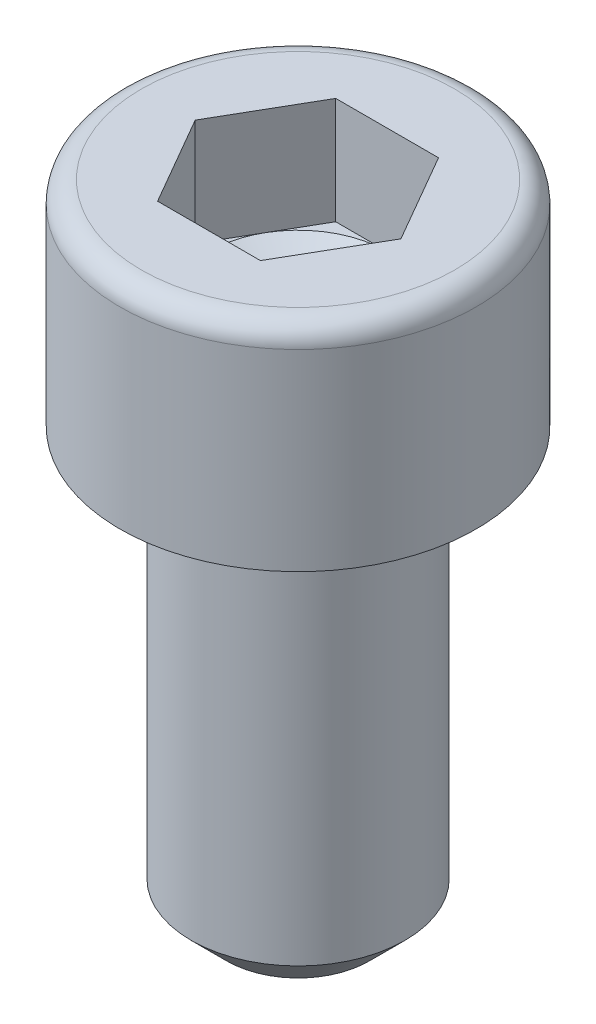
ISO-10303-21;
HEADER;
FILE_DESCRIPTION(('STEP AP214'),'2;1');
FILE_NAME('part.step','',(''),(''),'','','');
FILE_SCHEMA(('AUTOMOTIVE_DESIGN { 1 0 10303 214 1 1 1 1 }'));
ENDSEC;
DATA;
#1=APPLICATION_CONTEXT('core data for automotive mechanical design processes');
#2=APPLICATION_PROTOCOL_DEFINITION('international standard','automotive_design',2000,#1);
#3=PRODUCT_CONTEXT('',#1,'mechanical');
#4=PRODUCT('Part','Part','',(#3));
#5=PRODUCT_RELATED_PRODUCT_CATEGORY('part','',(#4));
#6=PRODUCT_DEFINITION_FORMATION('','',#4);
#7=PRODUCT_DEFINITION_CONTEXT('part definition',#1,'design');
#8=PRODUCT_DEFINITION('design','',#6,#7);
#9=PRODUCT_DEFINITION_SHAPE('','',#8);
#10=(LENGTH_UNIT() NAMED_UNIT(*) SI_UNIT(.MILLI.,.METRE.));
#11=(NAMED_UNIT(*) PLANE_ANGLE_UNIT() SI_UNIT($,.RADIAN.));
#12=(NAMED_UNIT(*) SI_UNIT($,.STERADIAN.) SOLID_ANGLE_UNIT());
#13=UNCERTAINTY_MEASURE_WITH_UNIT(LENGTH_MEASURE(1.E-05),#10,'distance_accuracy_value','');
#14=(GEOMETRIC_REPRESENTATION_CONTEXT(3) GLOBAL_UNCERTAINTY_ASSIGNED_CONTEXT((#13)) GLOBAL_UNIT_ASSIGNED_CONTEXT((#10,
#11,#12)) REPRESENTATION_CONTEXT('',''));
#15=CARTESIAN_POINT('',(0.,0.,0.));
#16=DIRECTION('',(0.,0.,1.));
#17=DIRECTION('',(1.,0.,0.));
#18=AXIS2_PLACEMENT_3D('',#15,#16,#17);
#19=CARTESIAN_POINT('',(2.5,6.,0.));
#20=DIRECTION('',(0.,-1.,0.));
#21=DIRECTION('',(1.,0.,0.));
#22=AXIS2_PLACEMENT_3D('',#19,#20,#21);
#23=PLANE('',#22);
#24=CARTESIAN_POINT('',(0.,6.,0.));
#25=DIRECTION('',(0.,1.,0.));
#26=DIRECTION('',(-1.,0.,0.));
#27=AXIS2_PLACEMENT_3D('',#24,#25,#26);
#28=CIRCLE('',#27,4.4);
#29=CARTESIAN_POINT('',(-4.4,6.,0.));
#30=VERTEX_POINT('',#29);
#31=EDGE_CURVE('E140',#30,#30,#28,.T.);
#32=ORIENTED_EDGE('',*,*,#31,.T.);
#33=EDGE_LOOP('',(#32));
#34=FACE_BOUND('',#33,.T.);
#35=DIRECTION('',(0.499999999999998,0.,0.86602540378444));
#36=VECTOR('',#35,1.);
#37=CARTESIAN_POINT('',(1.44337567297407,6.,-2.5));
#38=LINE('',#37,#36);
#39=CARTESIAN_POINT('',(1.44337567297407,6.,-2.5));
#40=VERTEX_POINT('',#39);
#41=CARTESIAN_POINT('',(2.88675134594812,6.,0.));
#42=VERTEX_POINT('',#41);
#43=EDGE_CURVE('E372',#40,#42,#38,.T.);
#44=ORIENTED_EDGE('',*,*,#43,.T.);
#45=DIRECTION('',(-0.499999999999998,0.,0.86602540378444));
#46=VECTOR('',#45,1.);
#47=CARTESIAN_POINT('',(1.44337567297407,6.,2.5));
#48=LINE('',#47,#46);
#49=CARTESIAN_POINT('',(1.44337567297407,6.,2.5));
#50=VERTEX_POINT('',#49);
#51=EDGE_CURVE('E375',#42,#50,#48,.T.);
#52=ORIENTED_EDGE('',*,*,#51,.T.);
#53=DIRECTION('',(-1.,0.,0.));
#54=VECTOR('',#53,1.);
#55=CARTESIAN_POINT('',(1.44337567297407,6.,2.5));
#56=LINE('',#55,#54);
#57=CARTESIAN_POINT('',(-1.44337567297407,6.,2.5));
#58=VERTEX_POINT('',#57);
#59=EDGE_CURVE('E378',#50,#58,#56,.T.);
#60=ORIENTED_EDGE('',*,*,#59,.T.);
#61=DIRECTION('',(-0.499999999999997,0.,-0.86602540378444));
#62=VECTOR('',#61,1.);
#63=CARTESIAN_POINT('',(-1.44337567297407,6.,2.5));
#64=LINE('',#63,#62);
#65=CARTESIAN_POINT('',(-2.88675134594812,6.,0.));
#66=VERTEX_POINT('',#65);
#67=EDGE_CURVE('E117',#58,#66,#64,.T.);
#68=ORIENTED_EDGE('',*,*,#67,.T.);
#69=DIRECTION('',(0.499999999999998,0.,-0.86602540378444));
#70=VECTOR('',#69,1.);
#71=CARTESIAN_POINT('',(-1.44337567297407,6.,-2.5));
#72=LINE('',#71,#70);
#73=CARTESIAN_POINT('',(-1.44337567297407,6.,-2.5));
#74=VERTEX_POINT('',#73);
#75=EDGE_CURVE('E369',#66,#74,#72,.T.);
#76=ORIENTED_EDGE('',*,*,#75,.T.);
#77=DIRECTION('',(1.,0.,0.));
#78=VECTOR('',#77,1.);
#79=CARTESIAN_POINT('',(1.44337567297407,6.,-2.5));
#80=LINE('',#79,#78);
#81=EDGE_CURVE('E128',#74,#40,#80,.T.);
#82=ORIENTED_EDGE('',*,*,#81,.T.);
#83=EDGE_LOOP('',(#44,#52,#60,#68,#76,#82));
#84=FACE_BOUND('',#83,.T.);
#85=ADVANCED_FACE('F34',(#34,#84),#23,.F.);
#86=CARTESIAN_POINT('',(0.,-12.,0.));
#87=DIRECTION('',(0.,1.,0.));
#88=DIRECTION('',(0.,0.,1.));
#89=AXIS2_PLACEMENT_3D('',#86,#87,#88);
#90=CYLINDRICAL_SURFACE('',#89,3.);
#91=CARTESIAN_POINT('',(0.,-11.,0.));
#92=DIRECTION('',(0.,1.,0.));
#93=DIRECTION('',(0.,0.,1.));
#94=AXIS2_PLACEMENT_3D('',#91,#92,#93);
#95=CIRCLE('',#94,3.);
#96=CARTESIAN_POINT('',(0.,-11.,3.));
#97=VERTEX_POINT('',#96);
#98=EDGE_CURVE('E42',#97,#97,#95,.T.);
#99=ORIENTED_EDGE('',*,*,#98,.T.);
#100=EDGE_LOOP('',(#99));
#101=FACE_BOUND('',#100,.T.);
#102=CARTESIAN_POINT('',(0.,0.,0.));
#103=DIRECTION('',(0.,1.,0.));
#104=DIRECTION('',(0.,0.,1.));
#105=AXIS2_PLACEMENT_3D('',#102,#103,#104);
#106=CIRCLE('',#105,3.);
#107=CARTESIAN_POINT('',(0.,0.,3.));
#108=VERTEX_POINT('',#107);
#109=EDGE_CURVE('E150',#108,#108,#106,.T.);
#110=ORIENTED_EDGE('',*,*,#109,.F.);
#111=EDGE_LOOP('',(#110));
#112=FACE_BOUND('',#111,.T.);
#113=ADVANCED_FACE('F155',(#101,#112),#90,.T.);
#114=CARTESIAN_POINT('',(0.,-12.,0.));
#115=DIRECTION('',(0.,1.,0.));
#116=DIRECTION('',(0.,0.,1.));
#117=AXIS2_PLACEMENT_3D('',#114,#115,#116);
#118=PLANE('',#117);
#119=CARTESIAN_POINT('',(0.,-12.,0.));
#120=DIRECTION('',(0.,1.,0.));
#121=DIRECTION('',(0.,0.,1.));
#122=AXIS2_PLACEMENT_3D('',#119,#120,#121);
#123=CIRCLE('',#122,2.);
#124=CARTESIAN_POINT('',(0.,-12.,2.));
#125=VERTEX_POINT('',#124);
#126=EDGE_CURVE('E11',#125,#125,#123,.F.);
#127=ORIENTED_EDGE('',*,*,#126,.T.);
#128=EDGE_LOOP('',(#127));
#129=FACE_BOUND('',#128,.T.);
#130=ADVANCED_FACE('F160',(#129),#118,.F.);
#131=CARTESIAN_POINT('',(0.,-11.,0.));
#132=DIRECTION('',(0.,1.,0.));
#133=DIRECTION('',(0.,0.,1.));
#134=AXIS2_PLACEMENT_3D('',#131,#132,#133);
#135=CONICAL_SURFACE('',#134,3.,0.78539816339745);
#136=ORIENTED_EDGE('',*,*,#126,.F.);
#137=EDGE_LOOP('',(#136));
#138=FACE_BOUND('',#137,.T.);
#139=ORIENTED_EDGE('',*,*,#98,.F.);
#140=EDGE_LOOP('',(#139));
#141=FACE_BOUND('',#140,.T.);
#142=ADVANCED_FACE('F36',(#138,#141),#135,.T.);
#143=CARTESIAN_POINT('',(0.,0.,0.));
#144=DIRECTION('',(0.,1.,0.));
#145=DIRECTION('',(-1.,0.,0.));
#146=AXIS2_PLACEMENT_3D('',#143,#144,#145);
#147=PLANE('',#146);
#148=ORIENTED_EDGE('',*,*,#109,.T.);
#149=EDGE_LOOP('',(#148));
#150=FACE_BOUND('',#149,.T.);
#151=CARTESIAN_POINT('',(0.,0.,0.));
#152=DIRECTION('',(0.,1.,0.));
#153=DIRECTION('',(-1.,0.,0.));
#154=AXIS2_PLACEMENT_3D('',#151,#152,#153);
#155=CIRCLE('',#154,5.);
#156=CARTESIAN_POINT('',(-5.,0.,0.));
#157=VERTEX_POINT('',#156);
#158=EDGE_CURVE('E147',#157,#157,#155,.T.);
#159=ORIENTED_EDGE('',*,*,#158,.F.);
#160=EDGE_LOOP('',(#159));
#161=FACE_BOUND('',#160,.T.);
#162=ADVANCED_FACE('F159',(#150,#161),#147,.F.);
#163=CARTESIAN_POINT('',(0.,6.,0.));
#164=DIRECTION('',(0.,1.,0.));
#165=DIRECTION('',(-1.,0.,0.));
#166=AXIS2_PLACEMENT_3D('',#163,#164,#165);
#167=CYLINDRICAL_SURFACE('',#166,5.);
#168=CARTESIAN_POINT('',(0.,5.4,0.));
#169=DIRECTION('',(0.,1.,0.));
#170=DIRECTION('',(-1.,0.,0.));
#171=AXIS2_PLACEMENT_3D('',#168,#169,#170);
#172=CIRCLE('',#171,5.);
#173=CARTESIAN_POINT('',(-5.,5.4,0.));
#174=VERTEX_POINT('',#173);
#175=EDGE_CURVE('E144',#174,#174,#172,.T.);
#176=ORIENTED_EDGE('',*,*,#175,.F.);
#177=EDGE_LOOP('',(#176));
#178=FACE_BOUND('',#177,.T.);
#179=ORIENTED_EDGE('',*,*,#158,.T.);
#180=EDGE_LOOP('',(#179));
#181=FACE_BOUND('',#180,.T.);
#182=ADVANCED_FACE('F166',(#178,#181),#167,.T.);
#183=CARTESIAN_POINT('',(0.,5.4,0.));
#184=DIRECTION('',(0.,1.,0.));
#185=DIRECTION('',(-1.,0.,0.));
#186=AXIS2_PLACEMENT_3D('',#183,#184,#185);
#187=TOROIDAL_SURFACE('',#186,4.4,0.6);
#188=ORIENTED_EDGE('',*,*,#31,.F.);
#189=EDGE_LOOP('',(#188));
#190=FACE_BOUND('',#189,.T.);
#191=ORIENTED_EDGE('',*,*,#175,.T.);
#192=EDGE_LOOP('',(#191));
#193=FACE_BOUND('',#192,.T.);
#194=ADVANCED_FACE('F183',(#190,#193),#187,.T.);
#195=CARTESIAN_POINT('',(-1.44337567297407,3.,-2.5));
#196=DIRECTION('',(0.86602540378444,0.,0.499999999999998));
#197=DIRECTION('',(0.499999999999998,0.,-0.86602540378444));
#198=AXIS2_PLACEMENT_3D('',#195,#196,#197);
#199=PLANE('',#198);
#200=ORIENTED_EDGE('',*,*,#75,.F.);
#201=DIRECTION('',(0.,1.,0.));
#202=VECTOR('',#201,1.);
#203=CARTESIAN_POINT('',(-2.88675134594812,3.,0.));
#204=LINE('',#203,#202);
#205=CARTESIAN_POINT('',(-2.88675134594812,3.,0.));
#206=VERTEX_POINT('',#205);
#207=EDGE_CURVE('E364',#206,#66,#204,.T.);
#208=ORIENTED_EDGE('',*,*,#207,.F.);
#209=DIRECTION('',(0.499999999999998,0.,-0.86602540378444));
#210=VECTOR('',#209,1.);
#211=CARTESIAN_POINT('',(-1.44337567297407,3.,-2.5));
#212=LINE('',#211,#210);
#213=CARTESIAN_POINT('',(-2.1650635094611,3.,-1.24999999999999));
#214=VERTEX_POINT('',#213);
#215=EDGE_CURVE('E113',#206,#214,#212,.T.);
#216=ORIENTED_EDGE('',*,*,#215,.T.);
#217=CARTESIAN_POINT('',(-1.44337567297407,3.,-2.5));
#218=VERTEX_POINT('',#217);
#219=EDGE_CURVE('E107',#214,#218,#212,.T.);
#220=ORIENTED_EDGE('',*,*,#219,.T.);
#221=DIRECTION('',(0.,1.,0.));
#222=VECTOR('',#221,1.);
#223=CARTESIAN_POINT('',(-1.44337567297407,3.,-2.5));
#224=LINE('',#223,#222);
#225=EDGE_CURVE('E109',#218,#74,#224,.T.);
#226=ORIENTED_EDGE('',*,*,#225,.T.);
#227=EDGE_LOOP('',(#200,#208,#216,#220,#226));
#228=FACE_BOUND('',#227,.T.);
#229=ADVANCED_FACE('F108',(#228),#199,.T.);
#230=CARTESIAN_POINT('',(1.44337567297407,3.,-2.5));
#231=DIRECTION('',(0.,0.,1.));
#232=DIRECTION('',(1.,0.,0.));
#233=AXIS2_PLACEMENT_3D('',#230,#231,#232);
#234=PLANE('',#233);
#235=ORIENTED_EDGE('',*,*,#81,.F.);
#236=ORIENTED_EDGE('',*,*,#225,.F.);
#237=DIRECTION('',(1.,0.,0.));
#238=VECTOR('',#237,1.);
#239=CARTESIAN_POINT('',(1.44337567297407,3.,-2.5));
#240=LINE('',#239,#238);
#241=CARTESIAN_POINT('',(0.,3.,-2.5));
#242=VERTEX_POINT('',#241);
#243=EDGE_CURVE('E49',#218,#242,#240,.T.);
#244=ORIENTED_EDGE('',*,*,#243,.T.);
#245=CARTESIAN_POINT('',(1.44337567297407,3.,-2.5));
#246=VERTEX_POINT('',#245);
#247=EDGE_CURVE('E123',#242,#246,#240,.T.);
#248=ORIENTED_EDGE('',*,*,#247,.T.);
#249=DIRECTION('',(0.,1.,0.));
#250=VECTOR('',#249,1.);
#251=CARTESIAN_POINT('',(1.44337567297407,3.,-2.5));
#252=LINE('',#251,#250);
#253=EDGE_CURVE('E130',#246,#40,#252,.T.);
#254=ORIENTED_EDGE('',*,*,#253,.T.);
#255=EDGE_LOOP('',(#235,#236,#244,#248,#254));
#256=FACE_BOUND('',#255,.T.);
#257=ADVANCED_FACE('F125',(#256),#234,.T.);
#258=CARTESIAN_POINT('',(1.44337567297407,3.,-2.5));
#259=DIRECTION('',(-0.86602540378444,0.,0.499999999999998));
#260=DIRECTION('',(0.499999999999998,0.,0.86602540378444));
#261=AXIS2_PLACEMENT_3D('',#258,#259,#260);
#262=PLANE('',#261);
#263=ORIENTED_EDGE('',*,*,#43,.F.);
#264=ORIENTED_EDGE('',*,*,#253,.F.);
#265=DIRECTION('',(0.499999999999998,0.,0.86602540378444));
#266=VECTOR('',#265,1.);
#267=CARTESIAN_POINT('',(1.44337567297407,3.,-2.5));
#268=LINE('',#267,#266);
#269=CARTESIAN_POINT('',(2.1650635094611,3.,-1.24999999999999));
#270=VERTEX_POINT('',#269);
#271=EDGE_CURVE('E397',#246,#270,#268,.T.);
#272=ORIENTED_EDGE('',*,*,#271,.T.);
#273=CARTESIAN_POINT('',(2.88675134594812,3.,0.));
#274=VERTEX_POINT('',#273);
#275=EDGE_CURVE('E122',#270,#274,#268,.T.);
#276=ORIENTED_EDGE('',*,*,#275,.T.);
#277=DIRECTION('',(0.,1.,0.));
#278=VECTOR('',#277,1.);
#279=CARTESIAN_POINT('',(2.88675134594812,3.,0.));
#280=LINE('',#279,#278);
#281=EDGE_CURVE('E135',#274,#42,#280,.T.);
#282=ORIENTED_EDGE('',*,*,#281,.T.);
#283=EDGE_LOOP('',(#263,#264,#272,#276,#282));
#284=FACE_BOUND('',#283,.T.);
#285=ADVANCED_FACE('F213',(#284),#262,.T.);
#286=CARTESIAN_POINT('',(1.44337567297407,3.,2.5));
#287=DIRECTION('',(-0.86602540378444,0.,-0.499999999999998));
#288=DIRECTION('',(-0.499999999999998,0.,0.86602540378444));
#289=AXIS2_PLACEMENT_3D('',#286,#287,#288);
#290=PLANE('',#289);
#291=ORIENTED_EDGE('',*,*,#51,.F.);
#292=ORIENTED_EDGE('',*,*,#281,.F.);
#293=DIRECTION('',(-0.499999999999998,0.,0.86602540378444));
#294=VECTOR('',#293,1.);
#295=CARTESIAN_POINT('',(1.44337567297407,3.,2.5));
#296=LINE('',#295,#294);
#297=CARTESIAN_POINT('',(2.1650635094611,3.,1.24999999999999));
#298=VERTEX_POINT('',#297);
#299=EDGE_CURVE('E395',#274,#298,#296,.T.);
#300=ORIENTED_EDGE('',*,*,#299,.T.);
#301=CARTESIAN_POINT('',(1.44337567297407,3.,2.5));
#302=VERTEX_POINT('',#301);
#303=EDGE_CURVE('E396',#298,#302,#296,.T.);
#304=ORIENTED_EDGE('',*,*,#303,.T.);
#305=DIRECTION('',(0.,1.,0.));
#306=VECTOR('',#305,1.);
#307=CARTESIAN_POINT('',(1.44337567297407,3.,2.5));
#308=LINE('',#307,#306);
#309=EDGE_CURVE('E384',#302,#50,#308,.T.);
#310=ORIENTED_EDGE('',*,*,#309,.T.);
#311=EDGE_LOOP('',(#291,#292,#300,#304,#310));
#312=FACE_BOUND('',#311,.T.);
#313=ADVANCED_FACE('F220',(#312),#290,.T.);
#314=CARTESIAN_POINT('',(1.44337567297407,3.,2.5));
#315=DIRECTION('',(0.,0.,-1.));
#316=DIRECTION('',(-1.,0.,0.));
#317=AXIS2_PLACEMENT_3D('',#314,#315,#316);
#318=PLANE('',#317);
#319=ORIENTED_EDGE('',*,*,#59,.F.);
#320=ORIENTED_EDGE('',*,*,#309,.F.);
#321=DIRECTION('',(-1.,0.,0.));
#322=VECTOR('',#321,1.);
#323=CARTESIAN_POINT('',(1.44337567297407,3.,2.5));
#324=LINE('',#323,#322);
#325=CARTESIAN_POINT('',(0.,3.,2.5));
#326=VERTEX_POINT('',#325);
#327=EDGE_CURVE('E359',#302,#326,#324,.T.);
#328=ORIENTED_EDGE('',*,*,#327,.T.);
#329=CARTESIAN_POINT('',(-1.44337567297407,3.,2.5));
#330=VERTEX_POINT('',#329);
#331=EDGE_CURVE('E355',#326,#330,#324,.T.);
#332=ORIENTED_EDGE('',*,*,#331,.T.);
#333=DIRECTION('',(0.,1.,0.));
#334=VECTOR('',#333,1.);
#335=CARTESIAN_POINT('',(-1.44337567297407,3.,2.5));
#336=LINE('',#335,#334);
#337=EDGE_CURVE('E363',#330,#58,#336,.T.);
#338=ORIENTED_EDGE('',*,*,#337,.T.);
#339=EDGE_LOOP('',(#319,#320,#328,#332,#338));
#340=FACE_BOUND('',#339,.T.);
#341=ADVANCED_FACE('F228',(#340),#318,.T.);
#342=CARTESIAN_POINT('',(-1.44337567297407,3.,2.5));
#343=DIRECTION('',(0.86602540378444,0.,-0.499999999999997));
#344=DIRECTION('',(-0.499999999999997,0.,-0.86602540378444));
#345=AXIS2_PLACEMENT_3D('',#342,#343,#344);
#346=PLANE('',#345);
#347=ORIENTED_EDGE('',*,*,#67,.F.);
#348=ORIENTED_EDGE('',*,*,#337,.F.);
#349=DIRECTION('',(-0.499999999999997,0.,-0.86602540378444));
#350=VECTOR('',#349,1.);
#351=CARTESIAN_POINT('',(-1.44337567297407,3.,2.5));
#352=LINE('',#351,#350);
#353=CARTESIAN_POINT('',(-2.1650635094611,3.,1.24999999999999));
#354=VERTEX_POINT('',#353);
#355=EDGE_CURVE('E354',#330,#354,#352,.T.);
#356=ORIENTED_EDGE('',*,*,#355,.T.);
#357=EDGE_CURVE('E357',#354,#206,#352,.T.);
#358=ORIENTED_EDGE('',*,*,#357,.T.);
#359=ORIENTED_EDGE('',*,*,#207,.T.);
#360=EDGE_LOOP('',(#347,#348,#356,#358,#359));
#361=FACE_BOUND('',#360,.T.);
#362=ADVANCED_FACE('F236',(#361),#346,.T.);
#363=CARTESIAN_POINT('',(-4.33012701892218,3.,2.5));
#364=DIRECTION('',(0.,-1.,0.));
#365=DIRECTION('',(0.,0.,-1.));
#366=AXIS2_PLACEMENT_3D('',#363,#364,#365);
#367=PLANE('',#366);
#368=ORIENTED_EDGE('',*,*,#243,.F.);
#369=ORIENTED_EDGE('',*,*,#219,.F.);
#370=CARTESIAN_POINT('',(0.,3.,0.));
#371=DIRECTION('',(0.,1.,0.));
#372=DIRECTION('',(-1.,0.,0.));
#373=AXIS2_PLACEMENT_3D('',#370,#371,#372);
#374=CIRCLE('',#373,2.5);
#375=EDGE_CURVE('E120',#242,#214,#374,.T.);
#376=ORIENTED_EDGE('',*,*,#375,.F.);
#377=EDGE_LOOP('',(#368,#369,#376));
#378=FACE_BOUND('',#377,.T.);
#379=ADVANCED_FACE('F119',(#378),#367,.F.);
#380=ORIENTED_EDGE('',*,*,#215,.F.);
#381=ORIENTED_EDGE('',*,*,#357,.F.);
#382=EDGE_CURVE('E129',#214,#354,#374,.T.);
#383=ORIENTED_EDGE('',*,*,#382,.F.);
#384=EDGE_LOOP('',(#380,#381,#383));
#385=FACE_BOUND('',#384,.T.);
#386=ADVANCED_FACE('F251',(#385),#367,.F.);
#387=ORIENTED_EDGE('',*,*,#355,.F.);
#388=ORIENTED_EDGE('',*,*,#331,.F.);
#389=EDGE_CURVE('E134',#354,#326,#374,.T.);
#390=ORIENTED_EDGE('',*,*,#389,.F.);
#391=EDGE_LOOP('',(#387,#388,#390));
#392=FACE_BOUND('',#391,.T.);
#393=ADVANCED_FACE('F259',(#392),#367,.F.);
#394=ORIENTED_EDGE('',*,*,#327,.F.);
#395=ORIENTED_EDGE('',*,*,#303,.F.);
#396=EDGE_CURVE('E141',#326,#298,#374,.T.);
#397=ORIENTED_EDGE('',*,*,#396,.F.);
#398=EDGE_LOOP('',(#394,#395,#397));
#399=FACE_BOUND('',#398,.T.);
#400=ADVANCED_FACE('F266',(#399),#367,.F.);
#401=ORIENTED_EDGE('',*,*,#299,.F.);
#402=ORIENTED_EDGE('',*,*,#275,.F.);
#403=EDGE_CURVE('E401',#298,#270,#374,.T.);
#404=ORIENTED_EDGE('',*,*,#403,.F.);
#405=EDGE_LOOP('',(#401,#402,#404));
#406=FACE_BOUND('',#405,.T.);
#407=ADVANCED_FACE('F273',(#406),#367,.F.);
#408=ORIENTED_EDGE('',*,*,#271,.F.);
#409=ORIENTED_EDGE('',*,*,#247,.F.);
#410=EDGE_CURVE('E400',#270,#242,#374,.T.);
#411=ORIENTED_EDGE('',*,*,#410,.F.);
#412=EDGE_LOOP('',(#408,#409,#411));
#413=FACE_BOUND('',#412,.T.);
#414=ADVANCED_FACE('F253',(#413),#367,.F.);
#415=CARTESIAN_POINT('',(0.,3.,0.));
#416=DIRECTION('',(0.,1.,0.));
#417=DIRECTION('',(-1.,0.,0.));
#418=AXIS2_PLACEMENT_3D('',#415,#416,#417);
#419=CONICAL_SURFACE('',#418,2.5,1.04719755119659);
#420=CARTESIAN_POINT('',(0.,1.55662432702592,0.));
#421=VERTEX_POINT('',#420);
#422=VERTEX_LOOP('',#421);
#423=FACE_BOUND('',#422,.T.);
#424=ORIENTED_EDGE('',*,*,#389,.T.);
#425=ORIENTED_EDGE('',*,*,#396,.T.);
#426=ORIENTED_EDGE('',*,*,#403,.T.);
#427=ORIENTED_EDGE('',*,*,#410,.T.);
#428=ORIENTED_EDGE('',*,*,#375,.T.);
#429=ORIENTED_EDGE('',*,*,#382,.T.);
#430=EDGE_LOOP('',(#424,#425,#426,#427,#428,#429));
#431=FACE_BOUND('',#430,.T.);
#432=ADVANCED_FACE('F181',(#423,#431),#419,.F.);
#433=CLOSED_SHELL('',(#85,#113,#130,#142,#162,#182,#194,#229,#257,#285,#313,#341,#362,#379,#386,
#393,#400,#407,#414,#432));
#434=MANIFOLD_SOLID_BREP('B2',#433);
#435=ADVANCED_BREP_SHAPE_REPRESENTATION('',(#18,#434),#14);
#436=SHAPE_DEFINITION_REPRESENTATION(#9,#435);
ENDSEC;
END-ISO-10303-21;
